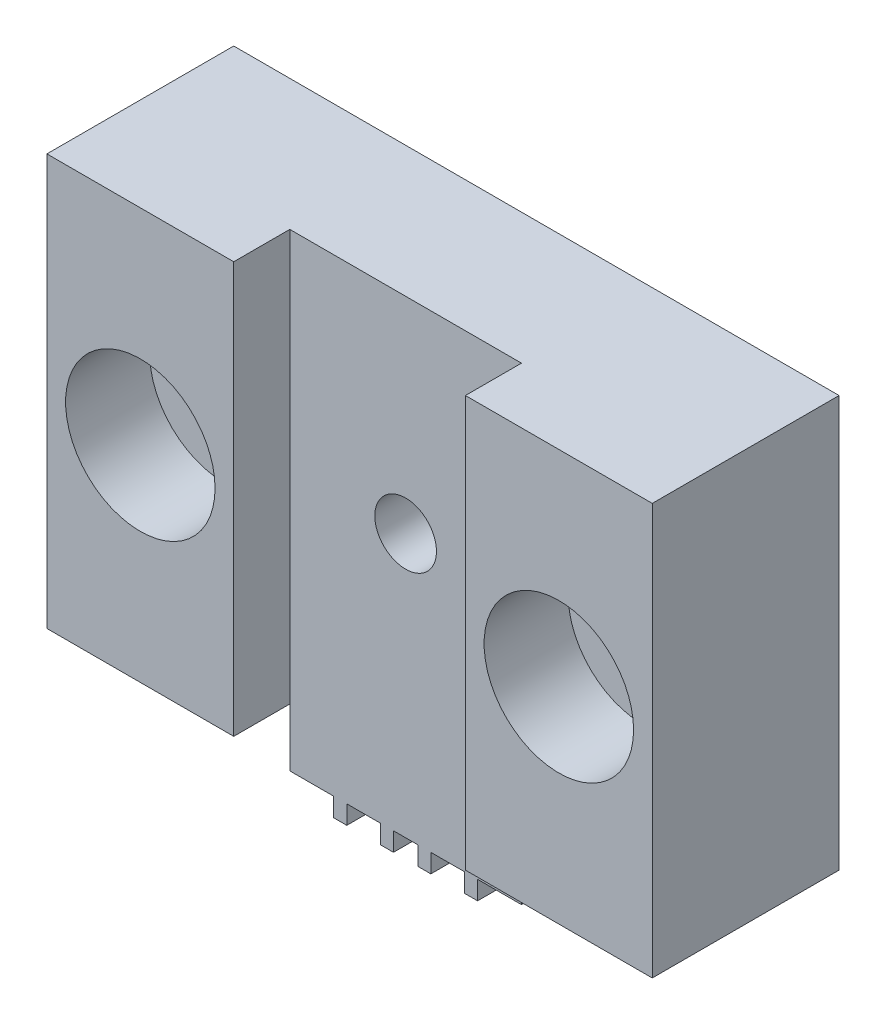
ISO-10303-21;
HEADER;
FILE_DESCRIPTION(('STEP AP214'),'2;1');
FILE_NAME('part.step','',(''),(''),'','','');
FILE_SCHEMA(('AUTOMOTIVE_DESIGN { 1 0 10303 214 1 1 1 1 }'));
ENDSEC;
DATA;
#1=APPLICATION_CONTEXT('core data for automotive mechanical design processes');
#2=APPLICATION_PROTOCOL_DEFINITION('international standard','automotive_design',2000,#1);
#3=PRODUCT_CONTEXT('',#1,'mechanical');
#4=PRODUCT('Part','Part','',(#3));
#5=PRODUCT_RELATED_PRODUCT_CATEGORY('part','',(#4));
#6=PRODUCT_DEFINITION_FORMATION('','',#4);
#7=PRODUCT_DEFINITION_CONTEXT('part definition',#1,'design');
#8=PRODUCT_DEFINITION('design','',#6,#7);
#9=PRODUCT_DEFINITION_SHAPE('','',#8);
#10=(LENGTH_UNIT() NAMED_UNIT(*) SI_UNIT(.MILLI.,.METRE.));
#11=(NAMED_UNIT(*) PLANE_ANGLE_UNIT() SI_UNIT($,.RADIAN.));
#12=(NAMED_UNIT(*) SI_UNIT($,.STERADIAN.) SOLID_ANGLE_UNIT());
#13=UNCERTAINTY_MEASURE_WITH_UNIT(LENGTH_MEASURE(1.E-05),#10,'distance_accuracy_value','');
#14=(GEOMETRIC_REPRESENTATION_CONTEXT(3) GLOBAL_UNCERTAINTY_ASSIGNED_CONTEXT((#13)) GLOBAL_UNIT_ASSIGNED_CONTEXT((#10,
#11,#12)) REPRESENTATION_CONTEXT('',''));
#15=CARTESIAN_POINT('',(0.,0.,0.));
#16=DIRECTION('',(0.,0.,1.));
#17=DIRECTION('',(1.,0.,0.));
#18=AXIS2_PLACEMENT_3D('',#15,#16,#17);
#19=CARTESIAN_POINT('',(12.350000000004,0.999999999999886,10.));
#20=DIRECTION('',(0.,0.,1.));
#21=DIRECTION('',(1.,0.,0.));
#22=AXIS2_PLACEMENT_3D('',#19,#20,#21);
#23=PLANE('',#22);
#24=CARTESIAN_POINT('',(27.4000000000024,15.1,10.));
#25=DIRECTION('',(0.,0.,1.));
#26=DIRECTION('',(1.,0.,0.));
#27=AXIS2_PLACEMENT_3D('',#24,#25,#26);
#28=CIRCLE('',#27,4.);
#29=CARTESIAN_POINT('',(31.4000000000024,15.1,10.));
#30=VERTEX_POINT('',#29);
#31=EDGE_CURVE('E332',#30,#30,#28,.T.);
#32=ORIENTED_EDGE('',*,*,#31,.F.);
#33=EDGE_LOOP('',(#32));
#34=FACE_BOUND('',#33,.T.);
#35=DIRECTION('',(-1.,0.,0.));
#36=VECTOR('',#35,1.);
#37=CARTESIAN_POINT('',(1.81898940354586E-12,26.0999999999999,10.));
#38=LINE('',#37,#36);
#39=CARTESIAN_POINT('',(32.4000000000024,26.0999999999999,10.));
#40=VERTEX_POINT('',#39);
#41=CARTESIAN_POINT('',(22.4000000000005,26.0999999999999,10.));
#42=VERTEX_POINT('',#41);
#43=EDGE_CURVE('E348',#40,#42,#38,.T.);
#44=ORIENTED_EDGE('',*,*,#43,.T.);
#45=DIRECTION('',(0.,1.,0.));
#46=VECTOR('',#45,1.);
#47=CARTESIAN_POINT('',(22.4000000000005,-1.14491749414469E-13,10.));
#48=LINE('',#47,#46);
#49=CARTESIAN_POINT('',(22.4000000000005,4.09999999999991,10.));
#50=VERTEX_POINT('',#49);
#51=EDGE_CURVE('E247',#50,#42,#48,.T.);
#52=ORIENTED_EDGE('',*,*,#51,.F.);
#53=DIRECTION('',(1.,0.,0.));
#54=VECTOR('',#53,1.);
#55=CARTESIAN_POINT('',(22.4000000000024,4.09999999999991,10.));
#56=LINE('',#55,#54);
#57=CARTESIAN_POINT('',(32.4000000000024,4.09999999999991,10.));
#58=VERTEX_POINT('',#57);
#59=EDGE_CURVE('E86',#50,#58,#56,.T.);
#60=ORIENTED_EDGE('',*,*,#59,.T.);
#61=DIRECTION('',(0.,1.,0.));
#62=VECTOR('',#61,1.);
#63=CARTESIAN_POINT('',(32.4000000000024,4.09999999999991,10.));
#64=LINE('',#63,#62);
#65=EDGE_CURVE('E346',#58,#40,#64,.T.);
#66=ORIENTED_EDGE('',*,*,#65,.T.);
#67=EDGE_LOOP('',(#44,#52,#60,#66));
#68=FACE_BOUND('',#67,.T.);
#69=ADVANCED_FACE('F34',(#34,#68),#23,.T.);
#70=CARTESIAN_POINT('',(5.00000000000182,15.1,10.));
#71=DIRECTION('',(0.,0.,1.));
#72=DIRECTION('',(1.,0.,0.));
#73=AXIS2_PLACEMENT_3D('',#70,#71,#72);
#74=CIRCLE('',#73,4.);
#75=CARTESIAN_POINT('',(9.00000000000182,15.1,10.));
#76=VERTEX_POINT('',#75);
#77=EDGE_CURVE('E321',#76,#76,#74,.T.);
#78=ORIENTED_EDGE('',*,*,#77,.F.);
#79=EDGE_LOOP('',(#78));
#80=FACE_BOUND('',#79,.T.);
#81=CARTESIAN_POINT('',(1.81898940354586E-12,4.09999999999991,10.));
#82=VERTEX_POINT('',#81);
#83=CARTESIAN_POINT('',(10.,4.09999999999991,10.));
#84=VERTEX_POINT('',#83);
#85=EDGE_CURVE('E58',#82,#84,#56,.T.);
#86=ORIENTED_EDGE('',*,*,#85,.T.);
#87=DIRECTION('',(0.,1.,0.));
#88=VECTOR('',#87,1.);
#89=CARTESIAN_POINT('',(10.,-1.14491749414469E-13,10.));
#90=LINE('',#89,#88);
#91=CARTESIAN_POINT('',(10.,26.0999999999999,10.));
#92=VERTEX_POINT('',#91);
#93=EDGE_CURVE('E50',#84,#92,#90,.T.);
#94=ORIENTED_EDGE('',*,*,#93,.T.);
#95=CARTESIAN_POINT('',(1.81898940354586E-12,26.0999999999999,10.));
#96=VERTEX_POINT('',#95);
#97=EDGE_CURVE('E243',#92,#96,#38,.T.);
#98=ORIENTED_EDGE('',*,*,#97,.T.);
#99=DIRECTION('',(0.,-1.,0.));
#100=VECTOR('',#99,1.);
#101=CARTESIAN_POINT('',(1.81898940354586E-12,4.09999999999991,10.));
#102=LINE('',#101,#100);
#103=EDGE_CURVE('E351',#96,#82,#102,.T.);
#104=ORIENTED_EDGE('',*,*,#103,.T.);
#105=EDGE_LOOP('',(#86,#94,#98,#104));
#106=FACE_BOUND('',#105,.T.);
#107=ADVANCED_FACE('F516',(#80,#106),#23,.T.);
#108=CARTESIAN_POINT('',(1.81898940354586E-12,26.0999999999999,10.));
#109=DIRECTION('',(0.,-1.,0.));
#110=DIRECTION('',(0.,0.,-1.));
#111=AXIS2_PLACEMENT_3D('',#108,#109,#110);
#112=PLANE('',#111);
#113=DIRECTION('',(0.,0.,1.));
#114=VECTOR('',#113,1.);
#115=CARTESIAN_POINT('',(22.4000000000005,26.0999999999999,10.));
#116=LINE('',#115,#114);
#117=CARTESIAN_POINT('',(22.4000000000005,26.0999999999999,7.));
#118=VERTEX_POINT('',#117);
#119=EDGE_CURVE('E238',#118,#42,#116,.T.);
#120=ORIENTED_EDGE('',*,*,#119,.T.);
#121=ORIENTED_EDGE('',*,*,#43,.F.);
#122=DIRECTION('',(0.,0.,-1.));
#123=VECTOR('',#122,1.);
#124=CARTESIAN_POINT('',(32.4000000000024,26.0999999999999,10.));
#125=LINE('',#124,#123);
#126=CARTESIAN_POINT('',(32.4000000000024,26.0999999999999,0.));
#127=VERTEX_POINT('',#126);
#128=EDGE_CURVE('E370',#40,#127,#125,.T.);
#129=ORIENTED_EDGE('',*,*,#128,.T.);
#130=DIRECTION('',(-1.,0.,0.));
#131=VECTOR('',#130,1.);
#132=CARTESIAN_POINT('',(1.81898940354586E-12,26.0999999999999,0.));
#133=LINE('',#132,#131);
#134=CARTESIAN_POINT('',(1.81898940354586E-12,26.0999999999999,0.));
#135=VERTEX_POINT('',#134);
#136=EDGE_CURVE('E355',#127,#135,#133,.T.);
#137=ORIENTED_EDGE('',*,*,#136,.T.);
#138=DIRECTION('',(0.,0.,-1.));
#139=VECTOR('',#138,1.);
#140=CARTESIAN_POINT('',(1.81898940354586E-12,26.0999999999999,10.));
#141=LINE('',#140,#139);
#142=EDGE_CURVE('E367',#96,#135,#141,.T.);
#143=ORIENTED_EDGE('',*,*,#142,.F.);
#144=ORIENTED_EDGE('',*,*,#97,.F.);
#145=DIRECTION('',(0.,0.,-1.));
#146=VECTOR('',#145,1.);
#147=CARTESIAN_POINT('',(10.,26.0999999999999,10.));
#148=LINE('',#147,#146);
#149=CARTESIAN_POINT('',(10.,26.0999999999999,7.));
#150=VERTEX_POINT('',#149);
#151=EDGE_CURVE('E224',#92,#150,#148,.T.);
#152=ORIENTED_EDGE('',*,*,#151,.T.);
#153=DIRECTION('',(1.,0.,0.));
#154=VECTOR('',#153,1.);
#155=CARTESIAN_POINT('',(10.,26.0999999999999,7.));
#156=LINE('',#155,#154);
#157=EDGE_CURVE('E231',#150,#118,#156,.T.);
#158=ORIENTED_EDGE('',*,*,#157,.T.);
#159=EDGE_LOOP('',(#120,#121,#129,#137,#143,#144,#152,#158));
#160=FACE_BOUND('',#159,.T.);
#161=ADVANCED_FACE('F241',(#160),#112,.F.);
#162=CARTESIAN_POINT('',(1.81898940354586E-12,4.09999999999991,10.));
#163=DIRECTION('',(0.,1.,0.));
#164=DIRECTION('',(0.,0.,1.));
#165=AXIS2_PLACEMENT_3D('',#162,#163,#164);
#166=PLANE('',#165);
#167=DIRECTION('',(0.,0.,1.));
#168=VECTOR('',#167,1.);
#169=CARTESIAN_POINT('',(22.4000000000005,4.09999999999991,10.));
#170=LINE('',#169,#168);
#171=CARTESIAN_POINT('',(22.4000000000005,4.09999999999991,7.));
#172=VERTEX_POINT('',#171);
#173=EDGE_CURVE('E252',#172,#50,#170,.T.);
#174=ORIENTED_EDGE('',*,*,#173,.F.);
#175=DIRECTION('',(0.,0.,-1.));
#176=VECTOR('',#175,1.);
#177=CARTESIAN_POINT('',(22.4000000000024,4.09999999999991,10.));
#178=LINE('',#177,#176);
#179=CARTESIAN_POINT('',(22.4000000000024,4.09999999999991,3.5));
#180=VERTEX_POINT('',#179);
#181=EDGE_CURVE('E375',#172,#180,#178,.T.);
#182=ORIENTED_EDGE('',*,*,#181,.T.);
#183=DIRECTION('',(1.,0.,0.));
#184=VECTOR('',#183,1.);
#185=CARTESIAN_POINT('',(1.81799020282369E-12,4.09999999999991,3.5));
#186=LINE('',#185,#184);
#187=CARTESIAN_POINT('',(10.0000000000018,4.09999999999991,3.5));
#188=VERTEX_POINT('',#187);
#189=EDGE_CURVE('E254',#188,#180,#186,.T.);
#190=ORIENTED_EDGE('',*,*,#189,.F.);
#191=DIRECTION('',(0.,0.,-1.));
#192=VECTOR('',#191,1.);
#193=CARTESIAN_POINT('',(10.0000000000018,4.09999999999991,10.));
#194=LINE('',#193,#192);
#195=CARTESIAN_POINT('',(10.,4.09999999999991,7.));
#196=VERTEX_POINT('',#195);
#197=EDGE_CURVE('E363',#196,#188,#194,.T.);
#198=ORIENTED_EDGE('',*,*,#197,.F.);
#199=DIRECTION('',(0.,0.,-1.));
#200=VECTOR('',#199,1.);
#201=CARTESIAN_POINT('',(10.,4.09999999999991,10.));
#202=LINE('',#201,#200);
#203=EDGE_CURVE('E225',#84,#196,#202,.T.);
#204=ORIENTED_EDGE('',*,*,#203,.F.);
#205=ORIENTED_EDGE('',*,*,#85,.F.);
#206=DIRECTION('',(0.,0.,-1.));
#207=VECTOR('',#206,1.);
#208=CARTESIAN_POINT('',(1.81898940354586E-12,4.09999999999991,10.));
#209=LINE('',#208,#207);
#210=CARTESIAN_POINT('',(1.81898940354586E-12,4.09999999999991,0.));
#211=VERTEX_POINT('',#210);
#212=EDGE_CURVE('E78',#82,#211,#209,.T.);
#213=ORIENTED_EDGE('',*,*,#212,.T.);
#214=DIRECTION('',(1.,0.,0.));
#215=VECTOR('',#214,1.);
#216=CARTESIAN_POINT('',(1.81898940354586E-12,4.09999999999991,0.));
#217=LINE('',#216,#215);
#218=CARTESIAN_POINT('',(32.4000000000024,4.09999999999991,0.));
#219=VERTEX_POINT('',#218);
#220=EDGE_CURVE('E359',#211,#219,#217,.T.);
#221=ORIENTED_EDGE('',*,*,#220,.T.);
#222=DIRECTION('',(0.,0.,-1.));
#223=VECTOR('',#222,1.);
#224=CARTESIAN_POINT('',(32.4000000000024,4.09999999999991,10.));
#225=LINE('',#224,#223);
#226=EDGE_CURVE('E373',#58,#219,#225,.T.);
#227=ORIENTED_EDGE('',*,*,#226,.F.);
#228=ORIENTED_EDGE('',*,*,#59,.F.);
#229=EDGE_LOOP('',(#174,#182,#190,#198,#204,#205,#213,#221,#227,#228));
#230=FACE_BOUND('',#229,.T.);
#231=ADVANCED_FACE('F443',(#230),#166,.F.);
#232=CARTESIAN_POINT('',(16.2000000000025,15.0999999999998,0.));
#233=DIRECTION('',(0.,0.,1.));
#234=DIRECTION('',(1.,0.,0.));
#235=AXIS2_PLACEMENT_3D('',#232,#233,#234);
#236=CYLINDRICAL_SURFACE('',#235,1.65);
#237=CARTESIAN_POINT('',(16.2000000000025,15.0999999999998,0.));
#238=DIRECTION('',(0.,0.,1.));
#239=DIRECTION('',(1.,0.,0.));
#240=AXIS2_PLACEMENT_3D('',#237,#238,#239);
#241=CIRCLE('',#240,1.65);
#242=CARTESIAN_POINT('',(17.8500000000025,15.0999999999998,0.));
#243=VERTEX_POINT('',#242);
#244=EDGE_CURVE('E341',#243,#243,#241,.T.);
#245=ORIENTED_EDGE('',*,*,#244,.F.);
#246=EDGE_LOOP('',(#245));
#247=FACE_BOUND('',#246,.T.);
#248=CARTESIAN_POINT('',(16.2000000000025,15.0999999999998,7.));
#249=DIRECTION('',(0.,0.,1.));
#250=DIRECTION('',(1.,0.,0.));
#251=AXIS2_PLACEMENT_3D('',#248,#249,#250);
#252=CIRCLE('',#251,1.65);
#253=CARTESIAN_POINT('',(17.8500000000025,15.0999999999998,7.));
#254=VERTEX_POINT('',#253);
#255=EDGE_CURVE('E38',#254,#254,#252,.F.);
#256=ORIENTED_EDGE('',*,*,#255,.F.);
#257=EDGE_LOOP('',(#256));
#258=FACE_BOUND('',#257,.T.);
#259=ADVANCED_FACE('F526',(#247,#258),#236,.F.);
#260=CARTESIAN_POINT('',(10.0000000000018,0.999999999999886,10.));
#261=DIRECTION('',(0.,1.,0.));
#262=DIRECTION('',(0.,0.,1.));
#263=AXIS2_PLACEMENT_3D('',#260,#261,#262);
#264=PLANE('',#263);
#265=DIRECTION('',(1.,0.,0.));
#266=VECTOR('',#265,1.);
#267=CARTESIAN_POINT('',(10.0000000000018,0.999999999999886,7.));
#268=LINE('',#267,#266);
#269=CARTESIAN_POINT('',(10.0000000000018,0.999999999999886,7.));
#270=VERTEX_POINT('',#269);
#271=CARTESIAN_POINT('',(12.350000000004,0.999999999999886,7.));
#272=VERTEX_POINT('',#271);
#273=EDGE_CURVE('E293',#270,#272,#268,.T.);
#274=ORIENTED_EDGE('',*,*,#273,.F.);
#275=DIRECTION('',(0.,0.,-1.));
#276=VECTOR('',#275,1.);
#277=CARTESIAN_POINT('',(10.0000000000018,0.999999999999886,10.));
#278=LINE('',#277,#276);
#279=CARTESIAN_POINT('',(10.0000000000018,0.999999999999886,3.5));
#280=VERTEX_POINT('',#279);
#281=EDGE_CURVE('E353',#270,#280,#278,.T.);
#282=ORIENTED_EDGE('',*,*,#281,.T.);
#283=DIRECTION('',(-1.,0.,0.));
#284=VECTOR('',#283,1.);
#285=CARTESIAN_POINT('',(10.0000000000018,0.999999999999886,3.5));
#286=LINE('',#285,#284);
#287=CARTESIAN_POINT('',(12.350000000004,0.999999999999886,3.5));
#288=VERTEX_POINT('',#287);
#289=EDGE_CURVE('E256',#288,#280,#286,.T.);
#290=ORIENTED_EDGE('',*,*,#289,.F.);
#291=DIRECTION('',(0.,0.,-1.));
#292=VECTOR('',#291,1.);
#293=CARTESIAN_POINT('',(12.350000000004,0.999999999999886,10.));
#294=LINE('',#293,#292);
#295=EDGE_CURVE('E426',#272,#288,#294,.T.);
#296=ORIENTED_EDGE('',*,*,#295,.F.);
#297=EDGE_LOOP('',(#274,#282,#290,#296));
#298=FACE_BOUND('',#297,.T.);
#299=ADVANCED_FACE('F36',(#298),#264,.F.);
#300=CARTESIAN_POINT('',(12.350000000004,-1.13686837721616E-13,10.));
#301=DIRECTION('',(1.,0.,0.));
#302=DIRECTION('',(0.,0.,-1.));
#303=AXIS2_PLACEMENT_3D('',#300,#301,#302);
#304=PLANE('',#303);
#305=DIRECTION('',(0.,-1.,0.));
#306=VECTOR('',#305,1.);
#307=CARTESIAN_POINT('',(12.350000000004,-1.13686837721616E-13,7.));
#308=LINE('',#307,#306);
#309=CARTESIAN_POINT('',(12.350000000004,-1.13686837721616E-13,7.));
#310=VERTEX_POINT('',#309);
#311=EDGE_CURVE('E295',#272,#310,#308,.T.);
#312=ORIENTED_EDGE('',*,*,#311,.F.);
#313=ORIENTED_EDGE('',*,*,#295,.T.);
#314=DIRECTION('',(0.,1.,0.));
#315=VECTOR('',#314,1.);
#316=CARTESIAN_POINT('',(12.350000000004,-1.13686837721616E-13,3.5));
#317=LINE('',#316,#315);
#318=CARTESIAN_POINT('',(12.350000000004,-1.13686837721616E-13,3.5));
#319=VERTEX_POINT('',#318);
#320=EDGE_CURVE('E267',#319,#288,#317,.T.);
#321=ORIENTED_EDGE('',*,*,#320,.F.);
#322=DIRECTION('',(0.,0.,-1.));
#323=VECTOR('',#322,1.);
#324=CARTESIAN_POINT('',(12.350000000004,-1.13686837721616E-13,10.));
#325=LINE('',#324,#323);
#326=EDGE_CURVE('E423',#310,#319,#325,.T.);
#327=ORIENTED_EDGE('',*,*,#326,.F.);
#328=EDGE_LOOP('',(#312,#313,#321,#327));
#329=FACE_BOUND('',#328,.T.);
#330=ADVANCED_FACE('F452',(#329),#304,.F.);
#331=CARTESIAN_POINT('',(12.350000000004,-1.13686837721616E-13,10.));
#332=DIRECTION('',(0.,1.,0.));
#333=DIRECTION('',(0.,0.,1.));
#334=AXIS2_PLACEMENT_3D('',#331,#332,#333);
#335=PLANE('',#334);
#336=DIRECTION('',(1.,0.,0.));
#337=VECTOR('',#336,1.);
#338=CARTESIAN_POINT('',(1.81799020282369E-12,-1.13686837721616E-13,7.));
#339=LINE('',#338,#337);
#340=CARTESIAN_POINT('',(13.0500000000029,-1.13686837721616E-13,7.));
#341=VERTEX_POINT('',#340);
#342=EDGE_CURVE('E262',#310,#341,#339,.T.);
#343=ORIENTED_EDGE('',*,*,#342,.F.);
#344=ORIENTED_EDGE('',*,*,#326,.T.);
#345=DIRECTION('',(1.,0.,0.));
#346=VECTOR('',#345,1.);
#347=CARTESIAN_POINT('',(1.81799020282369E-12,-1.13686837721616E-13,3.5));
#348=LINE('',#347,#346);
#349=CARTESIAN_POINT('',(13.0500000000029,-1.13686837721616E-13,3.5));
#350=VERTEX_POINT('',#349);
#351=EDGE_CURVE('E257',#319,#350,#348,.T.);
#352=ORIENTED_EDGE('',*,*,#351,.T.);
#353=DIRECTION('',(0.,0.,-1.));
#354=VECTOR('',#353,1.);
#355=CARTESIAN_POINT('',(13.0500000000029,-1.13686837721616E-13,10.));
#356=LINE('',#355,#354);
#357=EDGE_CURVE('E420',#341,#350,#356,.T.);
#358=ORIENTED_EDGE('',*,*,#357,.F.);
#359=EDGE_LOOP('',(#343,#344,#352,#358));
#360=FACE_BOUND('',#359,.T.);
#361=ADVANCED_FACE('F458',(#360),#335,.F.);
#362=CARTESIAN_POINT('',(13.0500000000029,-1.13686837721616E-13,10.));
#363=DIRECTION('',(-1.,0.,0.));
#364=DIRECTION('',(0.,0.,1.));
#365=AXIS2_PLACEMENT_3D('',#362,#363,#364);
#366=PLANE('',#365);
#367=DIRECTION('',(0.,1.,0.));
#368=VECTOR('',#367,1.);
#369=CARTESIAN_POINT('',(13.0500000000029,-1.13686837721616E-13,7.));
#370=LINE('',#369,#368);
#371=CARTESIAN_POINT('',(13.0500000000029,0.999999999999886,7.));
#372=VERTEX_POINT('',#371);
#373=EDGE_CURVE('E319',#341,#372,#370,.T.);
#374=ORIENTED_EDGE('',*,*,#373,.F.);
#375=ORIENTED_EDGE('',*,*,#357,.T.);
#376=DIRECTION('',(0.,-1.,0.));
#377=VECTOR('',#376,1.);
#378=CARTESIAN_POINT('',(13.0500000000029,-1.13686837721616E-13,3.5));
#379=LINE('',#378,#377);
#380=CARTESIAN_POINT('',(13.0500000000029,0.999999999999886,3.5));
#381=VERTEX_POINT('',#380);
#382=EDGE_CURVE('E291',#381,#350,#379,.T.);
#383=ORIENTED_EDGE('',*,*,#382,.F.);
#384=DIRECTION('',(0.,0.,-1.));
#385=VECTOR('',#384,1.);
#386=CARTESIAN_POINT('',(13.0500000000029,0.999999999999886,10.));
#387=LINE('',#386,#385);
#388=EDGE_CURVE('E417',#372,#381,#387,.T.);
#389=ORIENTED_EDGE('',*,*,#388,.F.);
#390=EDGE_LOOP('',(#374,#375,#383,#389));
#391=FACE_BOUND('',#390,.T.);
#392=ADVANCED_FACE('F483',(#391),#366,.F.);
#393=CARTESIAN_POINT('',(13.0500000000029,0.999999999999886,10.));
#394=DIRECTION('',(0.,1.,0.));
#395=DIRECTION('',(0.,0.,1.));
#396=AXIS2_PLACEMENT_3D('',#393,#394,#395);
#397=PLANE('',#396);
#398=DIRECTION('',(1.,0.,0.));
#399=VECTOR('',#398,1.);
#400=CARTESIAN_POINT('',(13.0500000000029,0.999999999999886,7.));
#401=LINE('',#400,#399);
#402=CARTESIAN_POINT('',(14.850000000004,0.999999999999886,7.));
#403=VERTEX_POINT('',#402);
#404=EDGE_CURVE('E317',#372,#403,#401,.T.);
#405=ORIENTED_EDGE('',*,*,#404,.F.);
#406=ORIENTED_EDGE('',*,*,#388,.T.);
#407=DIRECTION('',(-1.,0.,0.));
#408=VECTOR('',#407,1.);
#409=CARTESIAN_POINT('',(13.0500000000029,0.999999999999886,3.5));
#410=LINE('',#409,#408);
#411=CARTESIAN_POINT('',(14.850000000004,0.999999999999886,3.5));
#412=VERTEX_POINT('',#411);
#413=EDGE_CURVE('E289',#412,#381,#410,.T.);
#414=ORIENTED_EDGE('',*,*,#413,.F.);
#415=DIRECTION('',(0.,0.,-1.));
#416=VECTOR('',#415,1.);
#417=CARTESIAN_POINT('',(14.850000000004,0.999999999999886,10.));
#418=LINE('',#417,#416);
#419=EDGE_CURVE('E414',#403,#412,#418,.T.);
#420=ORIENTED_EDGE('',*,*,#419,.F.);
#421=EDGE_LOOP('',(#405,#406,#414,#420));
#422=FACE_BOUND('',#421,.T.);
#423=ADVANCED_FACE('F489',(#422),#397,.F.);
#424=CARTESIAN_POINT('',(14.850000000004,-1.13686837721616E-13,10.));
#425=DIRECTION('',(1.,0.,0.));
#426=DIRECTION('',(0.,0.,-1.));
#427=AXIS2_PLACEMENT_3D('',#424,#425,#426);
#428=PLANE('',#427);
#429=DIRECTION('',(0.,-1.,0.));
#430=VECTOR('',#429,1.);
#431=CARTESIAN_POINT('',(14.850000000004,-1.13686837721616E-13,7.));
#432=LINE('',#431,#430);
#433=CARTESIAN_POINT('',(14.850000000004,-1.13686837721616E-13,7.));
#434=VERTEX_POINT('',#433);
#435=EDGE_CURVE('E315',#403,#434,#432,.T.);
#436=ORIENTED_EDGE('',*,*,#435,.F.);
#437=ORIENTED_EDGE('',*,*,#419,.T.);
#438=DIRECTION('',(0.,1.,0.));
#439=VECTOR('',#438,1.);
#440=CARTESIAN_POINT('',(14.850000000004,-1.13686837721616E-13,3.5));
#441=LINE('',#440,#439);
#442=CARTESIAN_POINT('',(14.850000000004,-1.13686837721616E-13,3.5));
#443=VERTEX_POINT('',#442);
#444=EDGE_CURVE('E287',#443,#412,#441,.T.);
#445=ORIENTED_EDGE('',*,*,#444,.F.);
#446=DIRECTION('',(0.,0.,-1.));
#447=VECTOR('',#446,1.);
#448=CARTESIAN_POINT('',(14.850000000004,-1.13686837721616E-13,10.));
#449=LINE('',#448,#447);
#450=EDGE_CURVE('E411',#434,#443,#449,.T.);
#451=ORIENTED_EDGE('',*,*,#450,.F.);
#452=EDGE_LOOP('',(#436,#437,#445,#451));
#453=FACE_BOUND('',#452,.T.);
#454=ADVANCED_FACE('F493',(#453),#428,.F.);
#455=CARTESIAN_POINT('',(14.850000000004,-1.13686837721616E-13,10.));
#456=DIRECTION('',(0.,1.,0.));
#457=DIRECTION('',(0.,0.,1.));
#458=AXIS2_PLACEMENT_3D('',#455,#456,#457);
#459=PLANE('',#458);
#460=CARTESIAN_POINT('',(15.5500000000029,-1.13686837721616E-13,7.));
#461=VERTEX_POINT('',#460);
#462=EDGE_CURVE('E460',#434,#461,#339,.T.);
#463=ORIENTED_EDGE('',*,*,#462,.F.);
#464=ORIENTED_EDGE('',*,*,#450,.T.);
#465=CARTESIAN_POINT('',(15.5500000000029,-1.13686837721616E-13,3.5));
#466=VERTEX_POINT('',#465);
#467=EDGE_CURVE('E477',#443,#466,#348,.T.);
#468=ORIENTED_EDGE('',*,*,#467,.T.);
#469=DIRECTION('',(0.,0.,-1.));
#470=VECTOR('',#469,1.);
#471=CARTESIAN_POINT('',(15.5500000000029,-1.13686837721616E-13,10.));
#472=LINE('',#471,#470);
#473=EDGE_CURVE('E408',#461,#466,#472,.T.);
#474=ORIENTED_EDGE('',*,*,#473,.F.);
#475=EDGE_LOOP('',(#463,#464,#468,#474));
#476=FACE_BOUND('',#475,.T.);
#477=ADVANCED_FACE('F495',(#476),#459,.F.);
#478=CARTESIAN_POINT('',(15.5500000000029,-1.13686837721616E-13,10.));
#479=DIRECTION('',(-1.,0.,0.));
#480=DIRECTION('',(0.,0.,1.));
#481=AXIS2_PLACEMENT_3D('',#478,#479,#480);
#482=PLANE('',#481);
#483=DIRECTION('',(0.,1.,0.));
#484=VECTOR('',#483,1.);
#485=CARTESIAN_POINT('',(15.5500000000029,-1.13686837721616E-13,7.));
#486=LINE('',#485,#484);
#487=CARTESIAN_POINT('',(15.5500000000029,0.999999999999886,7.));
#488=VERTEX_POINT('',#487);
#489=EDGE_CURVE('E313',#461,#488,#486,.T.);
#490=ORIENTED_EDGE('',*,*,#489,.F.);
#491=ORIENTED_EDGE('',*,*,#473,.T.);
#492=DIRECTION('',(0.,-1.,0.));
#493=VECTOR('',#492,1.);
#494=CARTESIAN_POINT('',(15.5500000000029,-1.13686837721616E-13,3.5));
#495=LINE('',#494,#493);
#496=CARTESIAN_POINT('',(15.5500000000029,0.999999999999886,3.5));
#497=VERTEX_POINT('',#496);
#498=EDGE_CURVE('E285',#497,#466,#495,.T.);
#499=ORIENTED_EDGE('',*,*,#498,.F.);
#500=DIRECTION('',(0.,0.,-1.));
#501=VECTOR('',#500,1.);
#502=CARTESIAN_POINT('',(15.5500000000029,0.999999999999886,10.));
#503=LINE('',#502,#501);
#504=EDGE_CURVE('E405',#488,#497,#503,.T.);
#505=ORIENTED_EDGE('',*,*,#504,.F.);
#506=EDGE_LOOP('',(#490,#491,#499,#505));
#507=FACE_BOUND('',#506,.T.);
#508=ADVANCED_FACE('F498',(#507),#482,.F.);
#509=CARTESIAN_POINT('',(15.5500000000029,0.999999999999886,10.));
#510=DIRECTION('',(0.,1.,0.));
#511=DIRECTION('',(0.,0.,1.));
#512=AXIS2_PLACEMENT_3D('',#509,#510,#511);
#513=PLANE('',#512);
#514=DIRECTION('',(1.,0.,0.));
#515=VECTOR('',#514,1.);
#516=CARTESIAN_POINT('',(15.5500000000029,0.999999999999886,7.));
#517=LINE('',#516,#515);
#518=CARTESIAN_POINT('',(16.850000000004,0.999999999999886,7.));
#519=VERTEX_POINT('',#518);
#520=EDGE_CURVE('E311',#488,#519,#517,.T.);
#521=ORIENTED_EDGE('',*,*,#520,.F.);
#522=ORIENTED_EDGE('',*,*,#504,.T.);
#523=DIRECTION('',(-1.,0.,0.));
#524=VECTOR('',#523,1.);
#525=CARTESIAN_POINT('',(15.5500000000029,0.999999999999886,3.5));
#526=LINE('',#525,#524);
#527=CARTESIAN_POINT('',(16.850000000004,0.999999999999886,3.5));
#528=VERTEX_POINT('',#527);
#529=EDGE_CURVE('E283',#528,#497,#526,.T.);
#530=ORIENTED_EDGE('',*,*,#529,.F.);
#531=DIRECTION('',(0.,0.,-1.));
#532=VECTOR('',#531,1.);
#533=CARTESIAN_POINT('',(16.850000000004,0.999999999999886,10.));
#534=LINE('',#533,#532);
#535=EDGE_CURVE('E402',#519,#528,#534,.T.);
#536=ORIENTED_EDGE('',*,*,#535,.F.);
#537=EDGE_LOOP('',(#521,#522,#530,#536));
#538=FACE_BOUND('',#537,.T.);
#539=ADVANCED_FACE('F503',(#538),#513,.F.);
#540=CARTESIAN_POINT('',(16.850000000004,-1.13686837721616E-13,10.));
#541=DIRECTION('',(1.,0.,0.));
#542=DIRECTION('',(0.,0.,-1.));
#543=AXIS2_PLACEMENT_3D('',#540,#541,#542);
#544=PLANE('',#543);
#545=DIRECTION('',(0.,-1.,0.));
#546=VECTOR('',#545,1.);
#547=CARTESIAN_POINT('',(16.850000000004,-1.13686837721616E-13,7.));
#548=LINE('',#547,#546);
#549=CARTESIAN_POINT('',(16.850000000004,-1.13686837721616E-13,7.));
#550=VERTEX_POINT('',#549);
#551=EDGE_CURVE('E309',#519,#550,#548,.T.);
#552=ORIENTED_EDGE('',*,*,#551,.F.);
#553=ORIENTED_EDGE('',*,*,#535,.T.);
#554=DIRECTION('',(0.,1.,0.));
#555=VECTOR('',#554,1.);
#556=CARTESIAN_POINT('',(16.850000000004,-1.13686837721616E-13,3.5));
#557=LINE('',#556,#555);
#558=CARTESIAN_POINT('',(16.850000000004,-1.13686837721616E-13,3.5));
#559=VERTEX_POINT('',#558);
#560=EDGE_CURVE('E281',#559,#528,#557,.T.);
#561=ORIENTED_EDGE('',*,*,#560,.F.);
#562=DIRECTION('',(0.,0.,-1.));
#563=VECTOR('',#562,1.);
#564=CARTESIAN_POINT('',(16.850000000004,-1.13686837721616E-13,10.));
#565=LINE('',#564,#563);
#566=EDGE_CURVE('E399',#550,#559,#565,.T.);
#567=ORIENTED_EDGE('',*,*,#566,.F.);
#568=EDGE_LOOP('',(#552,#553,#561,#567));
#569=FACE_BOUND('',#568,.T.);
#570=ADVANCED_FACE('F506',(#569),#544,.F.);
#571=CARTESIAN_POINT('',(16.850000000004,-1.13686837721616E-13,10.));
#572=DIRECTION('',(0.,1.,0.));
#573=DIRECTION('',(0.,0.,1.));
#574=AXIS2_PLACEMENT_3D('',#571,#572,#573);
#575=PLANE('',#574);
#576=CARTESIAN_POINT('',(17.5500000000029,-1.13686837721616E-13,7.));
#577=VERTEX_POINT('',#576);
#578=EDGE_CURVE('E265',#550,#577,#339,.T.);
#579=ORIENTED_EDGE('',*,*,#578,.F.);
#580=ORIENTED_EDGE('',*,*,#566,.T.);
#581=CARTESIAN_POINT('',(17.5500000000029,-1.13686837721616E-13,3.5));
#582=VERTEX_POINT('',#581);
#583=EDGE_CURVE('E261',#559,#582,#348,.T.);
#584=ORIENTED_EDGE('',*,*,#583,.T.);
#585=DIRECTION('',(0.,0.,-1.));
#586=VECTOR('',#585,1.);
#587=CARTESIAN_POINT('',(17.5500000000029,-1.13686837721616E-13,10.));
#588=LINE('',#587,#586);
#589=EDGE_CURVE('E396',#577,#582,#588,.T.);
#590=ORIENTED_EDGE('',*,*,#589,.F.);
#591=EDGE_LOOP('',(#579,#580,#584,#590));
#592=FACE_BOUND('',#591,.T.);
#593=ADVANCED_FACE('F475',(#592),#575,.F.);
#594=CARTESIAN_POINT('',(17.5500000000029,-1.13686837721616E-13,10.));
#595=DIRECTION('',(-1.,0.,0.));
#596=DIRECTION('',(0.,0.,1.));
#597=AXIS2_PLACEMENT_3D('',#594,#595,#596);
#598=PLANE('',#597);
#599=DIRECTION('',(0.,1.,0.));
#600=VECTOR('',#599,1.);
#601=CARTESIAN_POINT('',(17.5500000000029,-1.13686837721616E-13,7.));
#602=LINE('',#601,#600);
#603=CARTESIAN_POINT('',(17.5500000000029,0.999999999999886,7.));
#604=VERTEX_POINT('',#603);
#605=EDGE_CURVE('E307',#577,#604,#602,.T.);
#606=ORIENTED_EDGE('',*,*,#605,.F.);
#607=ORIENTED_EDGE('',*,*,#589,.T.);
#608=DIRECTION('',(0.,-1.,0.));
#609=VECTOR('',#608,1.);
#610=CARTESIAN_POINT('',(17.5500000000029,-1.13686837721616E-13,3.5));
#611=LINE('',#610,#609);
#612=CARTESIAN_POINT('',(17.5500000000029,0.999999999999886,3.5));
#613=VERTEX_POINT('',#612);
#614=EDGE_CURVE('E279',#613,#582,#611,.T.);
#615=ORIENTED_EDGE('',*,*,#614,.F.);
#616=DIRECTION('',(0.,0.,-1.));
#617=VECTOR('',#616,1.);
#618=CARTESIAN_POINT('',(17.5500000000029,0.999999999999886,10.));
#619=LINE('',#618,#617);
#620=EDGE_CURVE('E393',#604,#613,#619,.T.);
#621=ORIENTED_EDGE('',*,*,#620,.F.);
#622=EDGE_LOOP('',(#606,#607,#615,#621));
#623=FACE_BOUND('',#622,.T.);
#624=ADVANCED_FACE('F472',(#623),#598,.F.);
#625=CARTESIAN_POINT('',(17.5500000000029,0.999999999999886,10.));
#626=DIRECTION('',(0.,1.,0.));
#627=DIRECTION('',(0.,0.,1.));
#628=AXIS2_PLACEMENT_3D('',#625,#626,#627);
#629=PLANE('',#628);
#630=DIRECTION('',(1.,0.,0.));
#631=VECTOR('',#630,1.);
#632=CARTESIAN_POINT('',(17.5500000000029,0.999999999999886,7.));
#633=LINE('',#632,#631);
#634=CARTESIAN_POINT('',(19.3500000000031,0.999999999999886,7.));
#635=VERTEX_POINT('',#634);
#636=EDGE_CURVE('E305',#604,#635,#633,.T.);
#637=ORIENTED_EDGE('',*,*,#636,.F.);
#638=ORIENTED_EDGE('',*,*,#620,.T.);
#639=DIRECTION('',(-1.,0.,0.));
#640=VECTOR('',#639,1.);
#641=CARTESIAN_POINT('',(17.5500000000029,0.999999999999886,3.5));
#642=LINE('',#641,#640);
#643=CARTESIAN_POINT('',(19.3500000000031,0.999999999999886,3.5));
#644=VERTEX_POINT('',#643);
#645=EDGE_CURVE('E277',#644,#613,#642,.T.);
#646=ORIENTED_EDGE('',*,*,#645,.F.);
#647=DIRECTION('',(0.,0.,-1.));
#648=VECTOR('',#647,1.);
#649=CARTESIAN_POINT('',(19.3500000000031,0.999999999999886,10.));
#650=LINE('',#649,#648);
#651=EDGE_CURVE('E390',#635,#644,#650,.T.);
#652=ORIENTED_EDGE('',*,*,#651,.F.);
#653=EDGE_LOOP('',(#637,#638,#646,#652));
#654=FACE_BOUND('',#653,.T.);
#655=ADVANCED_FACE('F568',(#654),#629,.F.);
#656=CARTESIAN_POINT('',(19.3500000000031,-1.13686837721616E-13,10.));
#657=DIRECTION('',(1.,0.,0.));
#658=DIRECTION('',(0.,0.,-1.));
#659=AXIS2_PLACEMENT_3D('',#656,#657,#658);
#660=PLANE('',#659);
#661=DIRECTION('',(0.,-1.,0.));
#662=VECTOR('',#661,1.);
#663=CARTESIAN_POINT('',(19.3500000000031,-1.13686837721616E-13,7.));
#664=LINE('',#663,#662);
#665=CARTESIAN_POINT('',(19.3500000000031,-1.13686837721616E-13,7.));
#666=VERTEX_POINT('',#665);
#667=EDGE_CURVE('E303',#635,#666,#664,.T.);
#668=ORIENTED_EDGE('',*,*,#667,.F.);
#669=ORIENTED_EDGE('',*,*,#651,.T.);
#670=DIRECTION('',(0.,1.,0.));
#671=VECTOR('',#670,1.);
#672=CARTESIAN_POINT('',(19.3500000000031,-1.13686837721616E-13,3.5));
#673=LINE('',#672,#671);
#674=CARTESIAN_POINT('',(19.3500000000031,-1.13686837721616E-13,3.5));
#675=VERTEX_POINT('',#674);
#676=EDGE_CURVE('E275',#675,#644,#673,.T.);
#677=ORIENTED_EDGE('',*,*,#676,.F.);
#678=DIRECTION('',(0.,0.,-1.));
#679=VECTOR('',#678,1.);
#680=CARTESIAN_POINT('',(19.3500000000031,-1.13686837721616E-13,10.));
#681=LINE('',#680,#679);
#682=EDGE_CURVE('E387',#666,#675,#681,.T.);
#683=ORIENTED_EDGE('',*,*,#682,.F.);
#684=EDGE_LOOP('',(#668,#669,#677,#683));
#685=FACE_BOUND('',#684,.T.);
#686=ADVANCED_FACE('F564',(#685),#660,.F.);
#687=CARTESIAN_POINT('',(19.3500000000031,-1.13686837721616E-13,10.));
#688=DIRECTION('',(0.,1.,0.));
#689=DIRECTION('',(0.,0.,1.));
#690=AXIS2_PLACEMENT_3D('',#687,#688,#689);
#691=PLANE('',#690);
#692=CARTESIAN_POINT('',(20.0500000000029,-1.13686837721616E-13,7.));
#693=VERTEX_POINT('',#692);
#694=EDGE_CURVE('E263',#666,#693,#339,.T.);
#695=ORIENTED_EDGE('',*,*,#694,.F.);
#696=ORIENTED_EDGE('',*,*,#682,.T.);
#697=CARTESIAN_POINT('',(20.0500000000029,-1.13686837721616E-13,3.5));
#698=VERTEX_POINT('',#697);
#699=EDGE_CURVE('E258',#675,#698,#348,.T.);
#700=ORIENTED_EDGE('',*,*,#699,.T.);
#701=DIRECTION('',(0.,0.,-1.));
#702=VECTOR('',#701,1.);
#703=CARTESIAN_POINT('',(20.0500000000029,-1.13686837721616E-13,10.));
#704=LINE('',#703,#702);
#705=EDGE_CURVE('E384',#693,#698,#704,.T.);
#706=ORIENTED_EDGE('',*,*,#705,.F.);
#707=EDGE_LOOP('',(#695,#696,#700,#706));
#708=FACE_BOUND('',#707,.T.);
#709=ADVANCED_FACE('F560',(#708),#691,.F.);
#710=CARTESIAN_POINT('',(20.0500000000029,-1.13686837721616E-13,10.));
#711=DIRECTION('',(-1.,0.,0.));
#712=DIRECTION('',(0.,0.,1.));
#713=AXIS2_PLACEMENT_3D('',#710,#711,#712);
#714=PLANE('',#713);
#715=DIRECTION('',(0.,1.,0.));
#716=VECTOR('',#715,1.);
#717=CARTESIAN_POINT('',(20.0500000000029,-1.13686837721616E-13,7.));
#718=LINE('',#717,#716);
#719=CARTESIAN_POINT('',(20.0500000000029,0.999999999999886,7.));
#720=VERTEX_POINT('',#719);
#721=EDGE_CURVE('E301',#693,#720,#718,.T.);
#722=ORIENTED_EDGE('',*,*,#721,.F.);
#723=ORIENTED_EDGE('',*,*,#705,.T.);
#724=DIRECTION('',(0.,-1.,0.));
#725=VECTOR('',#724,1.);
#726=CARTESIAN_POINT('',(20.0500000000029,-1.13686837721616E-13,3.5));
#727=LINE('',#726,#725);
#728=CARTESIAN_POINT('',(20.0500000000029,0.999999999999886,3.5));
#729=VERTEX_POINT('',#728);
#730=EDGE_CURVE('E273',#729,#698,#727,.T.);
#731=ORIENTED_EDGE('',*,*,#730,.F.);
#732=DIRECTION('',(0.,0.,-1.));
#733=VECTOR('',#732,1.);
#734=CARTESIAN_POINT('',(20.0500000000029,0.999999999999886,10.));
#735=LINE('',#734,#733);
#736=EDGE_CURVE('E381',#720,#729,#735,.T.);
#737=ORIENTED_EDGE('',*,*,#736,.F.);
#738=EDGE_LOOP('',(#722,#723,#731,#737));
#739=FACE_BOUND('',#738,.T.);
#740=ADVANCED_FACE('F556',(#739),#714,.F.);
#741=CARTESIAN_POINT('',(20.0500000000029,0.999999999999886,10.));
#742=DIRECTION('',(0.,1.,0.));
#743=DIRECTION('',(0.,0.,1.));
#744=AXIS2_PLACEMENT_3D('',#741,#742,#743);
#745=PLANE('',#744);
#746=DIRECTION('',(1.,0.,0.));
#747=VECTOR('',#746,1.);
#748=CARTESIAN_POINT('',(20.0500000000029,0.999999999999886,7.));
#749=LINE('',#748,#747);
#750=CARTESIAN_POINT('',(22.4000000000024,0.999999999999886,7.));
#751=VERTEX_POINT('',#750);
#752=EDGE_CURVE('E299',#720,#751,#749,.T.);
#753=ORIENTED_EDGE('',*,*,#752,.F.);
#754=ORIENTED_EDGE('',*,*,#736,.T.);
#755=DIRECTION('',(-1.,0.,0.));
#756=VECTOR('',#755,1.);
#757=CARTESIAN_POINT('',(20.0500000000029,0.999999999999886,3.5));
#758=LINE('',#757,#756);
#759=CARTESIAN_POINT('',(22.4000000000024,0.999999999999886,3.5));
#760=VERTEX_POINT('',#759);
#761=EDGE_CURVE('E271',#760,#729,#758,.T.);
#762=ORIENTED_EDGE('',*,*,#761,.F.);
#763=DIRECTION('',(0.,0.,-1.));
#764=VECTOR('',#763,1.);
#765=CARTESIAN_POINT('',(22.4000000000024,0.999999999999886,10.));
#766=LINE('',#765,#764);
#767=EDGE_CURVE('E378',#751,#760,#766,.T.);
#768=ORIENTED_EDGE('',*,*,#767,.F.);
#769=EDGE_LOOP('',(#753,#754,#762,#768));
#770=FACE_BOUND('',#769,.T.);
#771=ADVANCED_FACE('F552',(#770),#745,.F.);
#772=CARTESIAN_POINT('',(22.4000000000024,0.999999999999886,10.));
#773=DIRECTION('',(-1.,0.,0.));
#774=DIRECTION('',(0.,0.,1.));
#775=AXIS2_PLACEMENT_3D('',#772,#773,#774);
#776=PLANE('',#775);
#777=DIRECTION('',(0.,1.,0.));
#778=VECTOR('',#777,1.);
#779=CARTESIAN_POINT('',(22.4000000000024,0.999999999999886,7.));
#780=LINE('',#779,#778);
#781=EDGE_CURVE('E297',#751,#172,#780,.T.);
#782=ORIENTED_EDGE('',*,*,#781,.F.);
#783=ORIENTED_EDGE('',*,*,#767,.T.);
#784=DIRECTION('',(0.,-1.,0.));
#785=VECTOR('',#784,1.);
#786=CARTESIAN_POINT('',(22.4000000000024,0.999999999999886,3.5));
#787=LINE('',#786,#785);
#788=EDGE_CURVE('E269',#180,#760,#787,.T.);
#789=ORIENTED_EDGE('',*,*,#788,.F.);
#790=ORIENTED_EDGE('',*,*,#181,.F.);
#791=EDGE_LOOP('',(#782,#783,#789,#790));
#792=FACE_BOUND('',#791,.T.);
#793=ADVANCED_FACE('F535',(#792),#776,.F.);
#794=CARTESIAN_POINT('',(10.0000000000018,0.999999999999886,10.));
#795=DIRECTION('',(1.,0.,0.));
#796=DIRECTION('',(0.,0.,-1.));
#797=AXIS2_PLACEMENT_3D('',#794,#795,#796);
#798=PLANE('',#797);
#799=DIRECTION('',(0.,-1.,0.));
#800=VECTOR('',#799,1.);
#801=CARTESIAN_POINT('',(10.0000000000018,0.999999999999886,7.));
#802=LINE('',#801,#800);
#803=EDGE_CURVE('E12',#196,#270,#802,.T.);
#804=ORIENTED_EDGE('',*,*,#803,.F.);
#805=ORIENTED_EDGE('',*,*,#197,.T.);
#806=DIRECTION('',(0.,1.,0.));
#807=VECTOR('',#806,1.);
#808=CARTESIAN_POINT('',(10.0000000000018,0.999999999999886,3.5));
#809=LINE('',#808,#807);
#810=EDGE_CURVE('E43',#280,#188,#809,.T.);
#811=ORIENTED_EDGE('',*,*,#810,.F.);
#812=ORIENTED_EDGE('',*,*,#281,.F.);
#813=EDGE_LOOP('',(#804,#805,#811,#812));
#814=FACE_BOUND('',#813,.T.);
#815=ADVANCED_FACE('F445',(#814),#798,.F.);
#816=CARTESIAN_POINT('',(12.350000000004,0.999999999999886,0.));
#817=DIRECTION('',(0.,0.,1.));
#818=DIRECTION('',(1.,0.,0.));
#819=AXIS2_PLACEMENT_3D('',#816,#817,#818);
#820=PLANE('',#819);
#821=ORIENTED_EDGE('',*,*,#244,.T.);
#822=EDGE_LOOP('',(#821));
#823=FACE_BOUND('',#822,.T.);
#824=CARTESIAN_POINT('',(27.4000000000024,15.1,0.));
#825=DIRECTION('',(0.,0.,1.));
#826=DIRECTION('',(1.,0.,0.));
#827=AXIS2_PLACEMENT_3D('',#824,#825,#826);
#828=CIRCLE('',#827,2.25);
#829=CARTESIAN_POINT('',(29.6500000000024,15.1,0.));
#830=VERTEX_POINT('',#829);
#831=EDGE_CURVE('E338',#830,#830,#828,.T.);
#832=ORIENTED_EDGE('',*,*,#831,.T.);
#833=EDGE_LOOP('',(#832));
#834=FACE_BOUND('',#833,.T.);
#835=CARTESIAN_POINT('',(5.00000000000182,15.1,0.));
#836=DIRECTION('',(0.,0.,1.));
#837=DIRECTION('',(1.,0.,0.));
#838=AXIS2_PLACEMENT_3D('',#835,#836,#837);
#839=CIRCLE('',#838,2.25);
#840=CARTESIAN_POINT('',(7.25000000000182,15.1,0.));
#841=VERTEX_POINT('',#840);
#842=EDGE_CURVE('E335',#841,#841,#839,.T.);
#843=ORIENTED_EDGE('',*,*,#842,.T.);
#844=EDGE_LOOP('',(#843));
#845=FACE_BOUND('',#844,.T.);
#846=DIRECTION('',(0.,1.,0.));
#847=VECTOR('',#846,1.);
#848=CARTESIAN_POINT('',(32.4000000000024,4.09999999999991,0.));
#849=LINE('',#848,#847);
#850=EDGE_CURVE('E344',#219,#127,#849,.T.);
#851=ORIENTED_EDGE('',*,*,#850,.F.);
#852=ORIENTED_EDGE('',*,*,#220,.F.);
#853=DIRECTION('',(0.,-1.,0.));
#854=VECTOR('',#853,1.);
#855=CARTESIAN_POINT('',(1.81898940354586E-12,4.09999999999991,0.));
#856=LINE('',#855,#854);
#857=EDGE_CURVE('E357',#135,#211,#856,.T.);
#858=ORIENTED_EDGE('',*,*,#857,.F.);
#859=ORIENTED_EDGE('',*,*,#136,.F.);
#860=EDGE_LOOP('',(#851,#852,#858,#859));
#861=FACE_BOUND('',#860,.T.);
#862=ADVANCED_FACE('F528',(#823,#834,#845,#861),#820,.F.);
#863=CARTESIAN_POINT('',(5.00000000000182,15.1,0.));
#864=DIRECTION('',(0.,0.,1.));
#865=DIRECTION('',(1.,0.,0.));
#866=AXIS2_PLACEMENT_3D('',#863,#864,#865);
#867=CYLINDRICAL_SURFACE('',#866,2.25);
#868=ORIENTED_EDGE('',*,*,#842,.F.);
#869=EDGE_LOOP('',(#868));
#870=FACE_BOUND('',#869,.T.);
#871=CARTESIAN_POINT('',(5.00000000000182,15.1,5.5));
#872=DIRECTION('',(0.,0.,1.));
#873=DIRECTION('',(1.,0.,0.));
#874=AXIS2_PLACEMENT_3D('',#871,#872,#873);
#875=CIRCLE('',#874,2.25);
#876=CARTESIAN_POINT('',(7.25000000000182,15.1,5.5));
#877=VERTEX_POINT('',#876);
#878=EDGE_CURVE('E325',#877,#877,#875,.F.);
#879=ORIENTED_EDGE('',*,*,#878,.F.);
#880=EDGE_LOOP('',(#879));
#881=FACE_BOUND('',#880,.T.);
#882=ADVANCED_FACE('F531',(#870,#881),#867,.F.);
#883=CARTESIAN_POINT('',(27.4000000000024,15.1,0.));
#884=DIRECTION('',(0.,0.,1.));
#885=DIRECTION('',(1.,0.,0.));
#886=AXIS2_PLACEMENT_3D('',#883,#884,#885);
#887=CYLINDRICAL_SURFACE('',#886,2.25);
#888=ORIENTED_EDGE('',*,*,#831,.F.);
#889=EDGE_LOOP('',(#888));
#890=FACE_BOUND('',#889,.T.);
#891=CARTESIAN_POINT('',(27.4000000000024,15.1,5.5));
#892=DIRECTION('',(0.,0.,1.));
#893=DIRECTION('',(1.,0.,0.));
#894=AXIS2_PLACEMENT_3D('',#891,#892,#893);
#895=CIRCLE('',#894,2.25);
#896=CARTESIAN_POINT('',(29.6500000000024,15.1,5.5));
#897=VERTEX_POINT('',#896);
#898=EDGE_CURVE('E331',#897,#897,#895,.F.);
#899=ORIENTED_EDGE('',*,*,#898,.F.);
#900=EDGE_LOOP('',(#899));
#901=FACE_BOUND('',#900,.T.);
#902=ADVANCED_FACE('F548',(#890,#901),#887,.F.);
#903=CARTESIAN_POINT('',(32.4000000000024,4.09999999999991,10.));
#904=DIRECTION('',(-1.,0.,0.));
#905=DIRECTION('',(0.,0.,1.));
#906=AXIS2_PLACEMENT_3D('',#903,#904,#905);
#907=PLANE('',#906);
#908=ORIENTED_EDGE('',*,*,#850,.T.);
#909=ORIENTED_EDGE('',*,*,#128,.F.);
#910=ORIENTED_EDGE('',*,*,#65,.F.);
#911=ORIENTED_EDGE('',*,*,#226,.T.);
#912=EDGE_LOOP('',(#908,#909,#910,#911));
#913=FACE_BOUND('',#912,.T.);
#914=ADVANCED_FACE('F542',(#913),#907,.F.);
#915=CARTESIAN_POINT('',(1.81898940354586E-12,4.09999999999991,10.));
#916=DIRECTION('',(1.,0.,0.));
#917=DIRECTION('',(0.,0.,-1.));
#918=AXIS2_PLACEMENT_3D('',#915,#916,#917);
#919=PLANE('',#918);
#920=ORIENTED_EDGE('',*,*,#857,.T.);
#921=ORIENTED_EDGE('',*,*,#212,.F.);
#922=ORIENTED_EDGE('',*,*,#103,.F.);
#923=ORIENTED_EDGE('',*,*,#142,.T.);
#924=EDGE_LOOP('',(#920,#921,#922,#923));
#925=FACE_BOUND('',#924,.T.);
#926=ADVANCED_FACE('F538',(#925),#919,.F.);
#927=CARTESIAN_POINT('',(27.4000000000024,15.1,5.5));
#928=DIRECTION('',(0.,0.,1.));
#929=DIRECTION('',(1.,0.,0.));
#930=AXIS2_PLACEMENT_3D('',#927,#928,#929);
#931=PLANE('',#930);
#932=CARTESIAN_POINT('',(27.4000000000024,15.1,5.5));
#933=DIRECTION('',(0.,0.,1.));
#934=DIRECTION('',(1.,0.,0.));
#935=AXIS2_PLACEMENT_3D('',#932,#933,#934);
#936=CIRCLE('',#935,4.);
#937=CARTESIAN_POINT('',(31.4000000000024,15.1,5.5));
#938=VERTEX_POINT('',#937);
#939=EDGE_CURVE('E328',#938,#938,#936,.T.);
#940=ORIENTED_EDGE('',*,*,#939,.T.);
#941=EDGE_LOOP('',(#940));
#942=FACE_BOUND('',#941,.T.);
#943=ORIENTED_EDGE('',*,*,#898,.T.);
#944=EDGE_LOOP('',(#943));
#945=FACE_BOUND('',#944,.T.);
#946=ADVANCED_FACE('F541',(#942,#945),#931,.T.);
#947=CARTESIAN_POINT('',(27.4000000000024,15.1,5.5));
#948=DIRECTION('',(0.,0.,1.));
#949=DIRECTION('',(1.,0.,0.));
#950=AXIS2_PLACEMENT_3D('',#947,#948,#949);
#951=CYLINDRICAL_SURFACE('',#950,4.);
#952=ORIENTED_EDGE('',*,*,#939,.F.);
#953=EDGE_LOOP('',(#952));
#954=FACE_BOUND('',#953,.T.);
#955=ORIENTED_EDGE('',*,*,#31,.T.);
#956=EDGE_LOOP('',(#955));
#957=FACE_BOUND('',#956,.T.);
#958=ADVANCED_FACE('F640',(#954,#957),#951,.F.);
#959=CARTESIAN_POINT('',(5.00000000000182,15.1,5.5));
#960=DIRECTION('',(0.,0.,1.));
#961=DIRECTION('',(1.,0.,0.));
#962=AXIS2_PLACEMENT_3D('',#959,#960,#961);
#963=PLANE('',#962);
#964=CARTESIAN_POINT('',(5.00000000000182,15.1,5.5));
#965=DIRECTION('',(0.,0.,1.));
#966=DIRECTION('',(1.,0.,0.));
#967=AXIS2_PLACEMENT_3D('',#964,#965,#966);
#968=CIRCLE('',#967,4.);
#969=CARTESIAN_POINT('',(9.00000000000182,15.1,5.5));
#970=VERTEX_POINT('',#969);
#971=EDGE_CURVE('E322',#970,#970,#968,.T.);
#972=ORIENTED_EDGE('',*,*,#971,.T.);
#973=EDGE_LOOP('',(#972));
#974=FACE_BOUND('',#973,.T.);
#975=ORIENTED_EDGE('',*,*,#878,.T.);
#976=EDGE_LOOP('',(#975));
#977=FACE_BOUND('',#976,.T.);
#978=ADVANCED_FACE('F648',(#974,#977),#963,.T.);
#979=CARTESIAN_POINT('',(5.00000000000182,15.1,5.5));
#980=DIRECTION('',(0.,0.,1.));
#981=DIRECTION('',(1.,0.,0.));
#982=AXIS2_PLACEMENT_3D('',#979,#980,#981);
#983=CYLINDRICAL_SURFACE('',#982,4.);
#984=ORIENTED_EDGE('',*,*,#971,.F.);
#985=EDGE_LOOP('',(#984));
#986=FACE_BOUND('',#985,.T.);
#987=ORIENTED_EDGE('',*,*,#77,.T.);
#988=EDGE_LOOP('',(#987));
#989=FACE_BOUND('',#988,.T.);
#990=ADVANCED_FACE('F656',(#986,#989),#983,.F.);
#991=CARTESIAN_POINT('',(1.81799020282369E-12,-1.13686837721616E-13,3.5));
#992=DIRECTION('',(0.,0.,-1.));
#993=DIRECTION('',(-1.,0.,0.));
#994=AXIS2_PLACEMENT_3D('',#991,#992,#993);
#995=PLANE('',#994);
#996=ORIENTED_EDGE('',*,*,#382,.T.);
#997=ORIENTED_EDGE('',*,*,#351,.F.);
#998=ORIENTED_EDGE('',*,*,#320,.T.);
#999=ORIENTED_EDGE('',*,*,#289,.T.);
#1000=ORIENTED_EDGE('',*,*,#810,.T.);
#1001=ORIENTED_EDGE('',*,*,#189,.T.);
#1002=ORIENTED_EDGE('',*,*,#788,.T.);
#1003=ORIENTED_EDGE('',*,*,#761,.T.);
#1004=ORIENTED_EDGE('',*,*,#730,.T.);
#1005=ORIENTED_EDGE('',*,*,#699,.F.);
#1006=ORIENTED_EDGE('',*,*,#676,.T.);
#1007=ORIENTED_EDGE('',*,*,#645,.T.);
#1008=ORIENTED_EDGE('',*,*,#614,.T.);
#1009=ORIENTED_EDGE('',*,*,#583,.F.);
#1010=ORIENTED_EDGE('',*,*,#560,.T.);
#1011=ORIENTED_EDGE('',*,*,#529,.T.);
#1012=ORIENTED_EDGE('',*,*,#498,.T.);
#1013=ORIENTED_EDGE('',*,*,#467,.F.);
#1014=ORIENTED_EDGE('',*,*,#444,.T.);
#1015=ORIENTED_EDGE('',*,*,#413,.T.);
#1016=EDGE_LOOP('',(#996,#997,#998,#999,#1000,#1001,#1002,#1003,#1004,#1005,#1006,#1007,#1008,
#1009,#1010,#1011,#1012,#1013,#1014,#1015));
#1017=FACE_BOUND('',#1016,.T.);
#1018=ADVANCED_FACE('F436',(#1017),#995,.T.);
#1019=CARTESIAN_POINT('',(1.81799020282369E-12,-1.13686837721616E-13,7.));
#1020=DIRECTION('',(0.,0.,1.));
#1021=DIRECTION('',(1.,0.,0.));
#1022=AXIS2_PLACEMENT_3D('',#1019,#1020,#1021);
#1023=PLANE('',#1022);
#1024=ORIENTED_EDGE('',*,*,#373,.T.);
#1025=ORIENTED_EDGE('',*,*,#404,.T.);
#1026=ORIENTED_EDGE('',*,*,#435,.T.);
#1027=ORIENTED_EDGE('',*,*,#462,.T.);
#1028=ORIENTED_EDGE('',*,*,#489,.T.);
#1029=ORIENTED_EDGE('',*,*,#520,.T.);
#1030=ORIENTED_EDGE('',*,*,#551,.T.);
#1031=ORIENTED_EDGE('',*,*,#578,.T.);
#1032=ORIENTED_EDGE('',*,*,#605,.T.);
#1033=ORIENTED_EDGE('',*,*,#636,.T.);
#1034=ORIENTED_EDGE('',*,*,#667,.T.);
#1035=ORIENTED_EDGE('',*,*,#694,.T.);
#1036=ORIENTED_EDGE('',*,*,#721,.T.);
#1037=ORIENTED_EDGE('',*,*,#752,.T.);
#1038=ORIENTED_EDGE('',*,*,#781,.T.);
#1039=DIRECTION('',(0.,1.,0.));
#1040=VECTOR('',#1039,1.);
#1041=CARTESIAN_POINT('',(22.4000000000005,-1.14491749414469E-13,7.));
#1042=LINE('',#1041,#1040);
#1043=EDGE_CURVE('E228',#172,#118,#1042,.T.);
#1044=ORIENTED_EDGE('',*,*,#1043,.T.);
#1045=ORIENTED_EDGE('',*,*,#157,.F.);
#1046=DIRECTION('',(0.,1.,0.));
#1047=VECTOR('',#1046,1.);
#1048=CARTESIAN_POINT('',(10.,-1.14491749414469E-13,7.));
#1049=LINE('',#1048,#1047);
#1050=EDGE_CURVE('E220',#196,#150,#1049,.T.);
#1051=ORIENTED_EDGE('',*,*,#1050,.F.);
#1052=ORIENTED_EDGE('',*,*,#803,.T.);
#1053=ORIENTED_EDGE('',*,*,#273,.T.);
#1054=ORIENTED_EDGE('',*,*,#311,.T.);
#1055=ORIENTED_EDGE('',*,*,#342,.T.);
#1056=EDGE_LOOP('',(#1024,#1025,#1026,#1027,#1028,#1029,#1030,#1031,#1032,#1033,#1034,#1035,
#1036,#1037,#1038,#1044,#1045,#1051,#1052,#1053,#1054,#1055));
#1057=FACE_BOUND('',#1056,.T.);
#1058=ORIENTED_EDGE('',*,*,#255,.T.);
#1059=EDGE_LOOP('',(#1058));
#1060=FACE_BOUND('',#1059,.T.);
#1061=ADVANCED_FACE('F232',(#1057,#1060),#1023,.T.);
#1062=CARTESIAN_POINT('',(22.4000000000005,-1.14491749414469E-13,10.));
#1063=DIRECTION('',(-1.,0.,0.));
#1064=DIRECTION('',(0.,0.,1.));
#1065=AXIS2_PLACEMENT_3D('',#1062,#1063,#1064);
#1066=PLANE('',#1065);
#1067=ORIENTED_EDGE('',*,*,#173,.T.);
#1068=ORIENTED_EDGE('',*,*,#51,.T.);
#1069=ORIENTED_EDGE('',*,*,#119,.F.);
#1070=ORIENTED_EDGE('',*,*,#1043,.F.);
#1071=EDGE_LOOP('',(#1067,#1068,#1069,#1070));
#1072=FACE_BOUND('',#1071,.T.);
#1073=ADVANCED_FACE('F676',(#1072),#1066,.T.);
#1074=CARTESIAN_POINT('',(10.,-1.14491749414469E-13,10.));
#1075=DIRECTION('',(1.,0.,0.));
#1076=DIRECTION('',(0.,0.,-1.));
#1077=AXIS2_PLACEMENT_3D('',#1074,#1075,#1076);
#1078=PLANE('',#1077);
#1079=ORIENTED_EDGE('',*,*,#203,.T.);
#1080=ORIENTED_EDGE('',*,*,#1050,.T.);
#1081=ORIENTED_EDGE('',*,*,#151,.F.);
#1082=ORIENTED_EDGE('',*,*,#93,.F.);
#1083=EDGE_LOOP('',(#1079,#1080,#1081,#1082));
#1084=FACE_BOUND('',#1083,.T.);
#1085=ADVANCED_FACE('F222',(#1084),#1078,.T.);
#1086=CLOSED_SHELL('',(#69,#107,#161,#231,#259,#299,#330,#361,#392,#423,#454,#477,#508,#539,
#570,#593,#624,#655,#686,#709,#740,#771,#793,#815,#862,#882,#902,#914,#926,#946,#958,#978,#990,
#1018,#1061,#1073,#1085));
#1087=MANIFOLD_SOLID_BREP('B2',#1086);
#1088=ADVANCED_BREP_SHAPE_REPRESENTATION('',(#18,#1087),#14);
#1089=SHAPE_DEFINITION_REPRESENTATION(#9,#1088);
ENDSEC;
END-ISO-10303-21;
